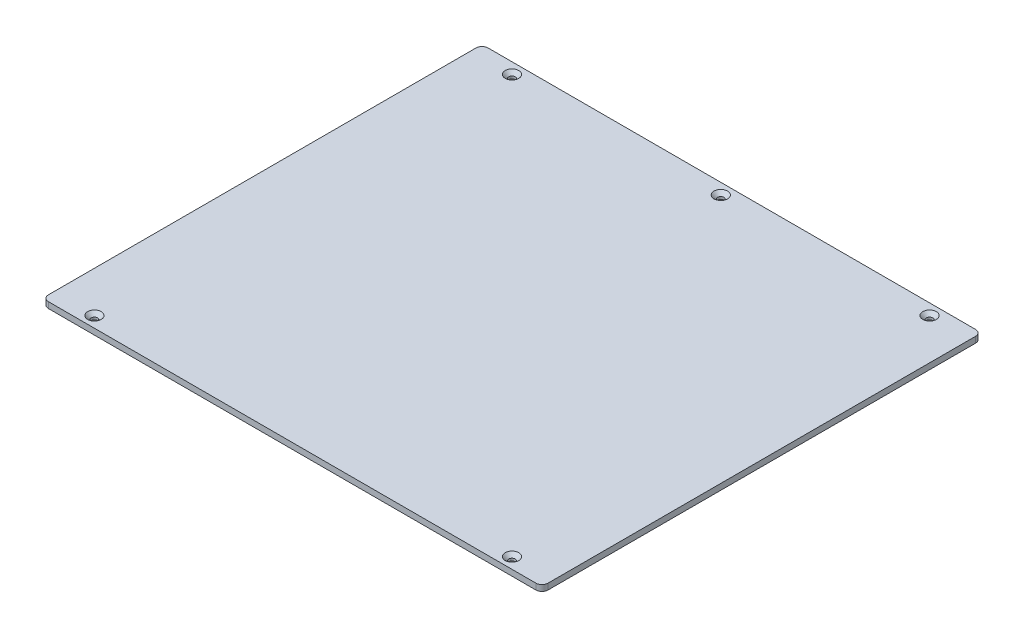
ISO-10303-21;
HEADER;
FILE_DESCRIPTION(('STEP AP214'),'2;1');
FILE_NAME('part.step','',(''),(''),'','','');
FILE_SCHEMA(('AUTOMOTIVE_DESIGN { 1 0 10303 214 1 1 1 1 }'));
ENDSEC;
DATA;
#1=APPLICATION_CONTEXT('core data for automotive mechanical design processes');
#2=APPLICATION_PROTOCOL_DEFINITION('international standard','automotive_design',2000,#1);
#3=PRODUCT_CONTEXT('',#1,'mechanical');
#4=PRODUCT('Part','Part','',(#3));
#5=PRODUCT_RELATED_PRODUCT_CATEGORY('part','',(#4));
#6=PRODUCT_DEFINITION_FORMATION('','',#4);
#7=PRODUCT_DEFINITION_CONTEXT('part definition',#1,'design');
#8=PRODUCT_DEFINITION('design','',#6,#7);
#9=PRODUCT_DEFINITION_SHAPE('','',#8);
#10=(LENGTH_UNIT() NAMED_UNIT(*) SI_UNIT(.MILLI.,.METRE.));
#11=(NAMED_UNIT(*) PLANE_ANGLE_UNIT() SI_UNIT($,.RADIAN.));
#12=(NAMED_UNIT(*) SI_UNIT($,.STERADIAN.) SOLID_ANGLE_UNIT());
#13=UNCERTAINTY_MEASURE_WITH_UNIT(LENGTH_MEASURE(1.E-05),#10,'distance_accuracy_value','');
#14=(GEOMETRIC_REPRESENTATION_CONTEXT(3) GLOBAL_UNCERTAINTY_ASSIGNED_CONTEXT((#13)) GLOBAL_UNIT_ASSIGNED_CONTEXT((#10,
#11,#12)) REPRESENTATION_CONTEXT('',''));
#15=CARTESIAN_POINT('',(0.,0.,0.));
#16=DIRECTION('',(0.,0.,1.));
#17=DIRECTION('',(1.,0.,0.));
#18=AXIS2_PLACEMENT_3D('',#15,#16,#17);
#19=CARTESIAN_POINT('',(0.,3.,0.));
#20=DIRECTION('',(0.,-1.,0.));
#21=DIRECTION('',(0.,0.,-1.));
#22=AXIS2_PLACEMENT_3D('',#19,#20,#21);
#23=PLANE('',#22);
#24=CARTESIAN_POINT('',(-104.5,3.,104.5));
#25=DIRECTION('',(0.,-1.,0.));
#26=DIRECTION('',(0.,0.,-1.));
#27=AXIS2_PLACEMENT_3D('',#24,#25,#26);
#28=CIRCLE('',#27,3.39999999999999);
#29=CARTESIAN_POINT('',(-104.5,3.,101.1));
#30=VERTEX_POINT('',#29);
#31=EDGE_CURVE('E159',#30,#30,#28,.T.);
#32=ORIENTED_EDGE('',*,*,#31,.T.);
#33=EDGE_LOOP('',(#32));
#34=FACE_BOUND('',#33,.T.);
#35=CARTESIAN_POINT('',(104.5,3.,104.5));
#36=DIRECTION('',(0.,-1.,0.));
#37=DIRECTION('',(0.,0.,-1.));
#38=AXIS2_PLACEMENT_3D('',#35,#36,#37);
#39=CIRCLE('',#38,3.39999999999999);
#40=CARTESIAN_POINT('',(104.5,3.,101.1));
#41=VERTEX_POINT('',#40);
#42=EDGE_CURVE('E156',#41,#41,#39,.T.);
#43=ORIENTED_EDGE('',*,*,#42,.T.);
#44=EDGE_LOOP('',(#43));
#45=FACE_BOUND('',#44,.T.);
#46=CARTESIAN_POINT('',(-104.5,3.,-104.5));
#47=DIRECTION('',(0.,-1.,0.));
#48=DIRECTION('',(0.,0.,-1.));
#49=AXIS2_PLACEMENT_3D('',#46,#47,#48);
#50=CIRCLE('',#49,3.39999999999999);
#51=CARTESIAN_POINT('',(-104.5,3.,-107.9));
#52=VERTEX_POINT('',#51);
#53=EDGE_CURVE('E153',#52,#52,#50,.T.);
#54=ORIENTED_EDGE('',*,*,#53,.T.);
#55=EDGE_LOOP('',(#54));
#56=FACE_BOUND('',#55,.T.);
#57=CARTESIAN_POINT('',(104.5,3.,-104.5));
#58=DIRECTION('',(0.,-1.,0.));
#59=DIRECTION('',(0.,0.,-1.));
#60=AXIS2_PLACEMENT_3D('',#57,#58,#59);
#61=CIRCLE('',#60,3.39999999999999);
#62=CARTESIAN_POINT('',(104.5,3.,-107.9));
#63=VERTEX_POINT('',#62);
#64=EDGE_CURVE('E150',#63,#63,#61,.T.);
#65=ORIENTED_EDGE('',*,*,#64,.T.);
#66=EDGE_LOOP('',(#65));
#67=FACE_BOUND('',#66,.T.);
#68=CARTESIAN_POINT('',(0.,3.,-104.5));
#69=DIRECTION('',(0.,-1.,0.));
#70=DIRECTION('',(0.,0.,-1.));
#71=AXIS2_PLACEMENT_3D('',#68,#69,#70);
#72=CIRCLE('',#71,3.39999999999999);
#73=CARTESIAN_POINT('',(0.,3.,-101.1));
#74=VERTEX_POINT('',#73);
#75=EDGE_CURVE('E147',#74,#74,#72,.T.);
#76=ORIENTED_EDGE('',*,*,#75,.T.);
#77=EDGE_LOOP('',(#76));
#78=FACE_BOUND('',#77,.T.);
#79=DIRECTION('',(1.,0.,0.));
#80=VECTOR('',#79,1.);
#81=CARTESIAN_POINT('',(-125.,3.,110.));
#82=LINE('',#81,#80);
#83=CARTESIAN_POINT('',(-122.,3.,110.));
#84=VERTEX_POINT('',#83);
#85=CARTESIAN_POINT('',(122.,3.,110.));
#86=VERTEX_POINT('',#85);
#87=EDGE_CURVE('E138',#84,#86,#82,.T.);
#88=ORIENTED_EDGE('',*,*,#87,.T.);
#89=CARTESIAN_POINT('',(122.,3.,107.));
#90=DIRECTION('',(0.,-1.,0.));
#91=DIRECTION('',(0.,0.,-1.));
#92=AXIS2_PLACEMENT_3D('',#89,#90,#91);
#93=CIRCLE('',#92,3.);
#94=CARTESIAN_POINT('',(125.,3.,107.));
#95=VERTEX_POINT('',#94);
#96=EDGE_CURVE('E187',#86,#95,#93,.F.);
#97=ORIENTED_EDGE('',*,*,#96,.T.);
#98=DIRECTION('',(0.,0.,-1.));
#99=VECTOR('',#98,1.);
#100=CARTESIAN_POINT('',(125.,3.,110.));
#101=LINE('',#100,#99);
#102=CARTESIAN_POINT('',(125.,3.,-107.));
#103=VERTEX_POINT('',#102);
#104=EDGE_CURVE('E121',#95,#103,#101,.T.);
#105=ORIENTED_EDGE('',*,*,#104,.T.);
#106=CARTESIAN_POINT('',(122.,3.,-107.));
#107=DIRECTION('',(0.,-1.,0.));
#108=DIRECTION('',(0.,0.,-1.));
#109=AXIS2_PLACEMENT_3D('',#106,#107,#108);
#110=CIRCLE('',#109,3.);
#111=CARTESIAN_POINT('',(122.,3.,-110.));
#112=VERTEX_POINT('',#111);
#113=EDGE_CURVE('E182',#103,#112,#110,.F.);
#114=ORIENTED_EDGE('',*,*,#113,.T.);
#115=DIRECTION('',(-1.,0.,0.));
#116=VECTOR('',#115,1.);
#117=CARTESIAN_POINT('',(-125.,3.,-110.));
#118=LINE('',#117,#116);
#119=CARTESIAN_POINT('',(-122.,3.,-110.));
#120=VERTEX_POINT('',#119);
#121=EDGE_CURVE('E198',#112,#120,#118,.T.);
#122=ORIENTED_EDGE('',*,*,#121,.T.);
#123=CARTESIAN_POINT('',(-122.,3.,-107.));
#124=DIRECTION('',(0.,-1.,0.));
#125=DIRECTION('',(0.,0.,-1.));
#126=AXIS2_PLACEMENT_3D('',#123,#124,#125);
#127=CIRCLE('',#126,3.);
#128=CARTESIAN_POINT('',(-125.,3.,-107.));
#129=VERTEX_POINT('',#128);
#130=EDGE_CURVE('E57',#120,#129,#127,.F.);
#131=ORIENTED_EDGE('',*,*,#130,.T.);
#132=DIRECTION('',(0.,0.,1.));
#133=VECTOR('',#132,1.);
#134=CARTESIAN_POINT('',(-125.,3.,110.));
#135=LINE('',#134,#133);
#136=CARTESIAN_POINT('',(-125.,3.,107.));
#137=VERTEX_POINT('',#136);
#138=EDGE_CURVE('E206',#129,#137,#135,.T.);
#139=ORIENTED_EDGE('',*,*,#138,.T.);
#140=CARTESIAN_POINT('',(-122.,3.,107.));
#141=DIRECTION('',(0.,-1.,0.));
#142=DIRECTION('',(0.,0.,-1.));
#143=AXIS2_PLACEMENT_3D('',#140,#141,#142);
#144=CIRCLE('',#143,3.);
#145=EDGE_CURVE('E185',#137,#84,#144,.F.);
#146=ORIENTED_EDGE('',*,*,#145,.T.);
#147=EDGE_LOOP('',(#88,#97,#105,#114,#122,#131,#139,#146));
#148=FACE_BOUND('',#147,.T.);
#149=ADVANCED_FACE('F35',(#34,#45,#56,#67,#78,#148),#23,.F.);
#150=CARTESIAN_POINT('',(0.,0.,0.));
#151=DIRECTION('',(0.,-1.,0.));
#152=DIRECTION('',(0.,0.,-1.));
#153=AXIS2_PLACEMENT_3D('',#150,#151,#152);
#154=PLANE('',#153);
#155=CARTESIAN_POINT('',(-104.5,0.,104.5));
#156=DIRECTION('',(0.,1.,0.));
#157=DIRECTION('',(0.,0.,1.));
#158=AXIS2_PLACEMENT_3D('',#155,#156,#157);
#159=CIRCLE('',#158,1.60000000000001);
#160=CARTESIAN_POINT('',(-104.5,0.,106.1));
#161=VERTEX_POINT('',#160);
#162=EDGE_CURVE('E217',#161,#161,#159,.T.);
#163=ORIENTED_EDGE('',*,*,#162,.T.);
#164=EDGE_LOOP('',(#163));
#165=FACE_BOUND('',#164,.T.);
#166=CARTESIAN_POINT('',(-104.5,0.,-104.5));
#167=DIRECTION('',(0.,1.,0.));
#168=DIRECTION('',(0.,0.,-1.));
#169=AXIS2_PLACEMENT_3D('',#166,#167,#168);
#170=CIRCLE('',#169,1.60000000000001);
#171=CARTESIAN_POINT('',(-104.5,0.,-106.1));
#172=VERTEX_POINT('',#171);
#173=EDGE_CURVE('E135',#172,#172,#170,.T.);
#174=ORIENTED_EDGE('',*,*,#173,.T.);
#175=EDGE_LOOP('',(#174));
#176=FACE_BOUND('',#175,.T.);
#177=DIRECTION('',(0.,0.,-1.));
#178=VECTOR('',#177,1.);
#179=CARTESIAN_POINT('',(125.,0.,110.));
#180=LINE('',#179,#178);
#181=CARTESIAN_POINT('',(125.,0.,107.));
#182=VERTEX_POINT('',#181);
#183=CARTESIAN_POINT('',(125.,0.,-107.));
#184=VERTEX_POINT('',#183);
#185=EDGE_CURVE('E118',#182,#184,#180,.T.);
#186=ORIENTED_EDGE('',*,*,#185,.F.);
#187=CARTESIAN_POINT('',(122.,0.,107.));
#188=DIRECTION('',(0.,-1.,0.));
#189=DIRECTION('',(0.,0.,-1.));
#190=AXIS2_PLACEMENT_3D('',#187,#188,#189);
#191=CIRCLE('',#190,3.);
#192=CARTESIAN_POINT('',(122.,0.,110.));
#193=VERTEX_POINT('',#192);
#194=EDGE_CURVE('E101',#182,#193,#191,.T.);
#195=ORIENTED_EDGE('',*,*,#194,.T.);
#196=DIRECTION('',(1.,0.,0.));
#197=VECTOR('',#196,1.);
#198=CARTESIAN_POINT('',(-125.,0.,110.));
#199=LINE('',#198,#197);
#200=CARTESIAN_POINT('',(-122.,0.,110.));
#201=VERTEX_POINT('',#200);
#202=EDGE_CURVE('E142',#201,#193,#199,.T.);
#203=ORIENTED_EDGE('',*,*,#202,.F.);
#204=CARTESIAN_POINT('',(-122.,0.,107.));
#205=DIRECTION('',(0.,-1.,0.));
#206=DIRECTION('',(0.,0.,-1.));
#207=AXIS2_PLACEMENT_3D('',#204,#205,#206);
#208=CIRCLE('',#207,3.);
#209=CARTESIAN_POINT('',(-125.,0.,107.));
#210=VERTEX_POINT('',#209);
#211=EDGE_CURVE('E112',#201,#210,#208,.T.);
#212=ORIENTED_EDGE('',*,*,#211,.T.);
#213=DIRECTION('',(0.,0.,1.));
#214=VECTOR('',#213,1.);
#215=CARTESIAN_POINT('',(-125.,0.,110.));
#216=LINE('',#215,#214);
#217=CARTESIAN_POINT('',(-125.,0.,-107.));
#218=VERTEX_POINT('',#217);
#219=EDGE_CURVE('E132',#218,#210,#216,.T.);
#220=ORIENTED_EDGE('',*,*,#219,.F.);
#221=CARTESIAN_POINT('',(-122.,0.,-107.));
#222=DIRECTION('',(0.,-1.,0.));
#223=DIRECTION('',(0.,0.,-1.));
#224=AXIS2_PLACEMENT_3D('',#221,#222,#223);
#225=CIRCLE('',#224,3.);
#226=CARTESIAN_POINT('',(-122.,0.,-110.));
#227=VERTEX_POINT('',#226);
#228=EDGE_CURVE('E176',#218,#227,#225,.T.);
#229=ORIENTED_EDGE('',*,*,#228,.T.);
#230=DIRECTION('',(-1.,0.,0.));
#231=VECTOR('',#230,1.);
#232=CARTESIAN_POINT('',(-125.,0.,-110.));
#233=LINE('',#232,#231);
#234=CARTESIAN_POINT('',(122.,0.,-110.));
#235=VERTEX_POINT('',#234);
#236=EDGE_CURVE('E128',#235,#227,#233,.T.);
#237=ORIENTED_EDGE('',*,*,#236,.F.);
#238=CARTESIAN_POINT('',(122.,0.,-107.));
#239=DIRECTION('',(0.,-1.,0.));
#240=DIRECTION('',(0.,0.,-1.));
#241=AXIS2_PLACEMENT_3D('',#238,#239,#240);
#242=CIRCLE('',#241,3.);
#243=EDGE_CURVE('E122',#235,#184,#242,.T.);
#244=ORIENTED_EDGE('',*,*,#243,.T.);
#245=EDGE_LOOP('',(#186,#195,#203,#212,#220,#229,#237,#244));
#246=FACE_BOUND('',#245,.T.);
#247=CARTESIAN_POINT('',(104.5,0.,-104.5));
#248=DIRECTION('',(0.,1.,0.));
#249=DIRECTION('',(0.,0.,1.));
#250=AXIS2_PLACEMENT_3D('',#247,#248,#249);
#251=CIRCLE('',#250,1.60000000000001);
#252=CARTESIAN_POINT('',(104.5,0.,-102.9));
#253=VERTEX_POINT('',#252);
#254=EDGE_CURVE('E129',#253,#253,#251,.T.);
#255=ORIENTED_EDGE('',*,*,#254,.T.);
#256=EDGE_LOOP('',(#255));
#257=FACE_BOUND('',#256,.T.);
#258=CARTESIAN_POINT('',(104.5,0.,104.5));
#259=DIRECTION('',(0.,1.,0.));
#260=DIRECTION('',(0.,0.,-1.));
#261=AXIS2_PLACEMENT_3D('',#258,#259,#260);
#262=CIRCLE('',#261,1.60000000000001);
#263=CARTESIAN_POINT('',(104.5,0.,102.9));
#264=VERTEX_POINT('',#263);
#265=EDGE_CURVE('E214',#264,#264,#262,.T.);
#266=ORIENTED_EDGE('',*,*,#265,.T.);
#267=EDGE_LOOP('',(#266));
#268=FACE_BOUND('',#267,.T.);
#269=CARTESIAN_POINT('',(0.,0.,-104.5));
#270=DIRECTION('',(0.,1.,0.));
#271=DIRECTION('',(0.,0.,1.));
#272=AXIS2_PLACEMENT_3D('',#269,#270,#271);
#273=CIRCLE('',#272,1.6);
#274=CARTESIAN_POINT('',(0.,0.,-102.9));
#275=VERTEX_POINT('',#274);
#276=EDGE_CURVE('E220',#275,#275,#273,.T.);
#277=ORIENTED_EDGE('',*,*,#276,.T.);
#278=EDGE_LOOP('',(#277));
#279=FACE_BOUND('',#278,.T.);
#280=ADVANCED_FACE('F125',(#165,#176,#246,#257,#268,#279),#154,.T.);
#281=CARTESIAN_POINT('',(125.,3.,110.));
#282=DIRECTION('',(-1.,0.,0.));
#283=DIRECTION('',(0.,0.,1.));
#284=AXIS2_PLACEMENT_3D('',#281,#282,#283);
#285=PLANE('',#284);
#286=ORIENTED_EDGE('',*,*,#104,.F.);
#287=DIRECTION('',(0.,-1.,0.));
#288=VECTOR('',#287,1.);
#289=CARTESIAN_POINT('',(125.,3.,107.));
#290=LINE('',#289,#288);
#291=EDGE_CURVE('E105',#95,#182,#290,.T.);
#292=ORIENTED_EDGE('',*,*,#291,.T.);
#293=ORIENTED_EDGE('',*,*,#185,.T.);
#294=DIRECTION('',(0.,-1.,0.));
#295=VECTOR('',#294,1.);
#296=CARTESIAN_POINT('',(125.,3.,-107.));
#297=LINE('',#296,#295);
#298=EDGE_CURVE('E123',#184,#103,#297,.F.);
#299=ORIENTED_EDGE('',*,*,#298,.T.);
#300=EDGE_LOOP('',(#286,#292,#293,#299));
#301=FACE_BOUND('',#300,.T.);
#302=ADVANCED_FACE('F117',(#301),#285,.F.);
#303=CARTESIAN_POINT('',(-125.,3.,-110.));
#304=DIRECTION('',(0.,0.,1.));
#305=DIRECTION('',(1.,0.,0.));
#306=AXIS2_PLACEMENT_3D('',#303,#304,#305);
#307=PLANE('',#306);
#308=ORIENTED_EDGE('',*,*,#236,.T.);
#309=DIRECTION('',(0.,-1.,0.));
#310=VECTOR('',#309,1.);
#311=CARTESIAN_POINT('',(-122.,3.,-110.));
#312=LINE('',#311,#310);
#313=EDGE_CURVE('E11',#227,#120,#312,.F.);
#314=ORIENTED_EDGE('',*,*,#313,.T.);
#315=ORIENTED_EDGE('',*,*,#121,.F.);
#316=DIRECTION('',(0.,-1.,0.));
#317=VECTOR('',#316,1.);
#318=CARTESIAN_POINT('',(122.,3.,-110.));
#319=LINE('',#318,#317);
#320=EDGE_CURVE('E43',#112,#235,#319,.T.);
#321=ORIENTED_EDGE('',*,*,#320,.T.);
#322=EDGE_LOOP('',(#308,#314,#315,#321));
#323=FACE_BOUND('',#322,.T.);
#324=ADVANCED_FACE('F196',(#323),#307,.F.);
#325=CARTESIAN_POINT('',(-125.,3.,110.));
#326=DIRECTION('',(1.,0.,0.));
#327=DIRECTION('',(0.,0.,-1.));
#328=AXIS2_PLACEMENT_3D('',#325,#326,#327);
#329=PLANE('',#328);
#330=ORIENTED_EDGE('',*,*,#219,.T.);
#331=DIRECTION('',(0.,-1.,0.));
#332=VECTOR('',#331,1.);
#333=CARTESIAN_POINT('',(-125.,3.,107.));
#334=LINE('',#333,#332);
#335=EDGE_CURVE('E50',#210,#137,#334,.F.);
#336=ORIENTED_EDGE('',*,*,#335,.T.);
#337=ORIENTED_EDGE('',*,*,#138,.F.);
#338=DIRECTION('',(0.,-1.,0.));
#339=VECTOR('',#338,1.);
#340=CARTESIAN_POINT('',(-125.,3.,-107.));
#341=LINE('',#340,#339);
#342=EDGE_CURVE('E189',#129,#218,#341,.T.);
#343=ORIENTED_EDGE('',*,*,#342,.T.);
#344=EDGE_LOOP('',(#330,#336,#337,#343));
#345=FACE_BOUND('',#344,.T.);
#346=ADVANCED_FACE('F205',(#345),#329,.F.);
#347=CARTESIAN_POINT('',(-125.,3.,110.));
#348=DIRECTION('',(0.,0.,-1.));
#349=DIRECTION('',(-1.,0.,0.));
#350=AXIS2_PLACEMENT_3D('',#347,#348,#349);
#351=PLANE('',#350);
#352=ORIENTED_EDGE('',*,*,#202,.T.);
#353=DIRECTION('',(0.,-1.,0.));
#354=VECTOR('',#353,1.);
#355=CARTESIAN_POINT('',(122.,3.,110.));
#356=LINE('',#355,#354);
#357=EDGE_CURVE('E106',#193,#86,#356,.F.);
#358=ORIENTED_EDGE('',*,*,#357,.T.);
#359=ORIENTED_EDGE('',*,*,#87,.F.);
#360=DIRECTION('',(0.,-1.,0.));
#361=VECTOR('',#360,1.);
#362=CARTESIAN_POINT('',(-122.,3.,110.));
#363=LINE('',#362,#361);
#364=EDGE_CURVE('E111',#84,#201,#363,.T.);
#365=ORIENTED_EDGE('',*,*,#364,.T.);
#366=EDGE_LOOP('',(#352,#358,#359,#365));
#367=FACE_BOUND('',#366,.T.);
#368=ADVANCED_FACE('F254',(#367),#351,.F.);
#369=CARTESIAN_POINT('',(104.5,3.,-104.5));
#370=DIRECTION('',(0.,-1.,0.));
#371=DIRECTION('',(0.,0.,-1.));
#372=AXIS2_PLACEMENT_3D('',#369,#370,#371);
#373=CYLINDRICAL_SURFACE('',#372,1.60000000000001);
#374=CARTESIAN_POINT('',(104.5,1.20000000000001,-104.5));
#375=DIRECTION('',(0.,-1.,0.));
#376=DIRECTION('',(0.,0.,-1.));
#377=AXIS2_PLACEMENT_3D('',#374,#375,#376);
#378=CIRCLE('',#377,1.60000000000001);
#379=CARTESIAN_POINT('',(104.5,1.20000000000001,-106.1));
#380=VERTEX_POINT('',#379);
#381=EDGE_CURVE('E168',#380,#380,#378,.F.);
#382=ORIENTED_EDGE('',*,*,#381,.T.);
#383=EDGE_LOOP('',(#382));
#384=FACE_BOUND('',#383,.T.);
#385=ORIENTED_EDGE('',*,*,#254,.F.);
#386=EDGE_LOOP('',(#385));
#387=FACE_BOUND('',#386,.T.);
#388=ADVANCED_FACE('F251',(#384,#387),#373,.F.);
#389=CARTESIAN_POINT('',(-104.5,3.,-104.5));
#390=DIRECTION('',(0.,-1.,0.));
#391=DIRECTION('',(0.,0.,-1.));
#392=AXIS2_PLACEMENT_3D('',#389,#390,#391);
#393=CYLINDRICAL_SURFACE('',#392,1.60000000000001);
#394=CARTESIAN_POINT('',(-104.5,1.20000000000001,-104.5));
#395=DIRECTION('',(0.,-1.,0.));
#396=DIRECTION('',(0.,0.,-1.));
#397=AXIS2_PLACEMENT_3D('',#394,#395,#396);
#398=CIRCLE('',#397,1.60000000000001);
#399=CARTESIAN_POINT('',(-104.5,1.20000000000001,-106.1));
#400=VERTEX_POINT('',#399);
#401=EDGE_CURVE('E165',#400,#400,#398,.F.);
#402=ORIENTED_EDGE('',*,*,#401,.T.);
#403=EDGE_LOOP('',(#402));
#404=FACE_BOUND('',#403,.T.);
#405=ORIENTED_EDGE('',*,*,#173,.F.);
#406=EDGE_LOOP('',(#405));
#407=FACE_BOUND('',#406,.T.);
#408=ADVANCED_FACE('F393',(#404,#407),#393,.F.);
#409=CARTESIAN_POINT('',(104.5,3.,104.5));
#410=DIRECTION('',(0.,-1.,0.));
#411=DIRECTION('',(0.,0.,-1.));
#412=AXIS2_PLACEMENT_3D('',#409,#410,#411);
#413=CYLINDRICAL_SURFACE('',#412,1.60000000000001);
#414=CARTESIAN_POINT('',(104.5,1.20000000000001,104.5));
#415=DIRECTION('',(0.,-1.,0.));
#416=DIRECTION('',(0.,0.,-1.));
#417=AXIS2_PLACEMENT_3D('',#414,#415,#416);
#418=CIRCLE('',#417,1.60000000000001);
#419=CARTESIAN_POINT('',(104.5,1.20000000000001,102.9));
#420=VERTEX_POINT('',#419);
#421=EDGE_CURVE('E162',#420,#420,#418,.F.);
#422=ORIENTED_EDGE('',*,*,#421,.T.);
#423=EDGE_LOOP('',(#422));
#424=FACE_BOUND('',#423,.T.);
#425=ORIENTED_EDGE('',*,*,#265,.F.);
#426=EDGE_LOOP('',(#425));
#427=FACE_BOUND('',#426,.T.);
#428=ADVANCED_FACE('F238',(#424,#427),#413,.F.);
#429=CARTESIAN_POINT('',(-104.5,3.,104.5));
#430=DIRECTION('',(0.,-1.,0.));
#431=DIRECTION('',(0.,0.,-1.));
#432=AXIS2_PLACEMENT_3D('',#429,#430,#431);
#433=CYLINDRICAL_SURFACE('',#432,1.60000000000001);
#434=CARTESIAN_POINT('',(-104.5,1.20000000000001,104.5));
#435=DIRECTION('',(0.,-1.,0.));
#436=DIRECTION('',(0.,0.,-1.));
#437=AXIS2_PLACEMENT_3D('',#434,#435,#436);
#438=CIRCLE('',#437,1.60000000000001);
#439=CARTESIAN_POINT('',(-104.5,1.20000000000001,102.9));
#440=VERTEX_POINT('',#439);
#441=EDGE_CURVE('E144',#440,#440,#438,.F.);
#442=ORIENTED_EDGE('',*,*,#441,.T.);
#443=EDGE_LOOP('',(#442));
#444=FACE_BOUND('',#443,.T.);
#445=ORIENTED_EDGE('',*,*,#162,.F.);
#446=EDGE_LOOP('',(#445));
#447=FACE_BOUND('',#446,.T.);
#448=ADVANCED_FACE('F228',(#444,#447),#433,.F.);
#449=CARTESIAN_POINT('',(0.,3.,-104.5));
#450=DIRECTION('',(0.,-1.,0.));
#451=DIRECTION('',(0.,0.,-1.));
#452=AXIS2_PLACEMENT_3D('',#449,#450,#451);
#453=CYLINDRICAL_SURFACE('',#452,1.6);
#454=CARTESIAN_POINT('',(0.,1.20000000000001,-104.5));
#455=DIRECTION('',(0.,-1.,0.));
#456=DIRECTION('',(0.,0.,-1.));
#457=AXIS2_PLACEMENT_3D('',#454,#455,#456);
#458=CIRCLE('',#457,1.6);
#459=CARTESIAN_POINT('',(0.,1.20000000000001,-102.9));
#460=VERTEX_POINT('',#459);
#461=EDGE_CURVE('E171',#460,#460,#458,.F.);
#462=ORIENTED_EDGE('',*,*,#461,.T.);
#463=EDGE_LOOP('',(#462));
#464=FACE_BOUND('',#463,.T.);
#465=ORIENTED_EDGE('',*,*,#276,.F.);
#466=EDGE_LOOP('',(#465));
#467=FACE_BOUND('',#466,.T.);
#468=ADVANCED_FACE('F225',(#464,#467),#453,.F.);
#469=CARTESIAN_POINT('',(-104.5,1.20000000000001,104.5));
#470=DIRECTION('',(0.,1.,0.));
#471=DIRECTION('',(0.,0.,1.));
#472=AXIS2_PLACEMENT_3D('',#469,#470,#471);
#473=CONICAL_SURFACE('',#472,1.60000000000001,0.785398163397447);
#474=ORIENTED_EDGE('',*,*,#31,.F.);
#475=EDGE_LOOP('',(#474));
#476=FACE_BOUND('',#475,.T.);
#477=ORIENTED_EDGE('',*,*,#441,.F.);
#478=EDGE_LOOP('',(#477));
#479=FACE_BOUND('',#478,.T.);
#480=ADVANCED_FACE('F227',(#476,#479),#473,.F.);
#481=CARTESIAN_POINT('',(104.5,1.20000000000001,104.5));
#482=DIRECTION('',(0.,1.,0.));
#483=DIRECTION('',(0.,0.,1.));
#484=AXIS2_PLACEMENT_3D('',#481,#482,#483);
#485=CONICAL_SURFACE('',#484,1.60000000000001,0.785398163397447);
#486=ORIENTED_EDGE('',*,*,#42,.F.);
#487=EDGE_LOOP('',(#486));
#488=FACE_BOUND('',#487,.T.);
#489=ORIENTED_EDGE('',*,*,#421,.F.);
#490=EDGE_LOOP('',(#489));
#491=FACE_BOUND('',#490,.T.);
#492=ADVANCED_FACE('F235',(#488,#491),#485,.F.);
#493=CARTESIAN_POINT('',(-104.5,1.20000000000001,-104.5));
#494=DIRECTION('',(0.,1.,0.));
#495=DIRECTION('',(0.,0.,1.));
#496=AXIS2_PLACEMENT_3D('',#493,#494,#495);
#497=CONICAL_SURFACE('',#496,1.60000000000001,0.785398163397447);
#498=ORIENTED_EDGE('',*,*,#53,.F.);
#499=EDGE_LOOP('',(#498));
#500=FACE_BOUND('',#499,.T.);
#501=ORIENTED_EDGE('',*,*,#401,.F.);
#502=EDGE_LOOP('',(#501));
#503=FACE_BOUND('',#502,.T.);
#504=ADVANCED_FACE('F266',(#500,#503),#497,.F.);
#505=CARTESIAN_POINT('',(104.5,1.20000000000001,-104.5));
#506=DIRECTION('',(0.,1.,0.));
#507=DIRECTION('',(0.,0.,1.));
#508=AXIS2_PLACEMENT_3D('',#505,#506,#507);
#509=CONICAL_SURFACE('',#508,1.60000000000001,0.785398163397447);
#510=ORIENTED_EDGE('',*,*,#64,.F.);
#511=EDGE_LOOP('',(#510));
#512=FACE_BOUND('',#511,.T.);
#513=ORIENTED_EDGE('',*,*,#381,.F.);
#514=EDGE_LOOP('',(#513));
#515=FACE_BOUND('',#514,.T.);
#516=ADVANCED_FACE('F270',(#512,#515),#509,.F.);
#517=CARTESIAN_POINT('',(0.,1.20000000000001,-104.5));
#518=DIRECTION('',(0.,1.,0.));
#519=DIRECTION('',(0.,0.,1.));
#520=AXIS2_PLACEMENT_3D('',#517,#518,#519);
#521=CONICAL_SURFACE('',#520,1.6,0.785398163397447);
#522=CARTESIAN_POINT('',(0.,3.,-101.1));
#523=CARTESIAN_POINT('',(0.,2.98125,-101.11875));
#524=CARTESIAN_POINT('',(0.,2.9625,-101.1375));
#525=CARTESIAN_POINT('',(0.,2.925,-101.175));
#526=CARTESIAN_POINT('',(0.,2.90625,-101.19375));
#527=CARTESIAN_POINT('',(0.,2.86875,-101.23125));
#528=CARTESIAN_POINT('',(0.,2.85,-101.25));
#529=CARTESIAN_POINT('',(0.,2.8125,-101.2875));
#530=CARTESIAN_POINT('',(0.,2.79375,-101.30625));
#531=CARTESIAN_POINT('',(0.,2.75625,-101.34375));
#532=CARTESIAN_POINT('',(0.,2.7375,-101.3625));
#533=CARTESIAN_POINT('',(0.,2.7,-101.4));
#534=CARTESIAN_POINT('',(0.,2.68125,-101.41875));
#535=CARTESIAN_POINT('',(0.,2.64375,-101.45625));
#536=CARTESIAN_POINT('',(0.,2.625,-101.475));
#537=CARTESIAN_POINT('',(0.,2.5875,-101.5125));
#538=CARTESIAN_POINT('',(0.,2.56875,-101.53125));
#539=CARTESIAN_POINT('',(0.,2.53125,-101.56875));
#540=CARTESIAN_POINT('',(0.,2.5125,-101.5875));
#541=CARTESIAN_POINT('',(0.,2.475,-101.625));
#542=CARTESIAN_POINT('',(0.,2.45625,-101.64375));
#543=CARTESIAN_POINT('',(0.,2.41875,-101.68125));
#544=CARTESIAN_POINT('',(0.,2.4,-101.7));
#545=CARTESIAN_POINT('',(0.,2.3625,-101.7375));
#546=CARTESIAN_POINT('',(0.,2.34375000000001,-101.75625));
#547=CARTESIAN_POINT('',(0.,2.30625000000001,-101.79375));
#548=CARTESIAN_POINT('',(0.,2.2875,-101.8125));
#549=CARTESIAN_POINT('',(0.,2.25,-101.85));
#550=CARTESIAN_POINT('',(0.,2.23125000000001,-101.86875));
#551=CARTESIAN_POINT('',(0.,2.19375000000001,-101.90625));
#552=CARTESIAN_POINT('',(0.,2.175,-101.925));
#553=CARTESIAN_POINT('',(0.,2.1375,-101.9625));
#554=CARTESIAN_POINT('',(0.,2.11875000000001,-101.98125));
#555=CARTESIAN_POINT('',(0.,2.08125000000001,-102.01875));
#556=CARTESIAN_POINT('',(0.,2.06250000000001,-102.0375));
#557=CARTESIAN_POINT('',(0.,2.025,-102.075));
#558=CARTESIAN_POINT('',(0.,2.00625,-102.09375));
#559=CARTESIAN_POINT('',(0.,1.96875000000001,-102.13125));
#560=CARTESIAN_POINT('',(0.,1.95000000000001,-102.15));
#561=CARTESIAN_POINT('',(0.,1.91250000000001,-102.1875));
#562=CARTESIAN_POINT('',(0.,1.89375000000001,-102.20625));
#563=CARTESIAN_POINT('',(0.,1.85625000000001,-102.24375));
#564=CARTESIAN_POINT('',(0.,1.83750000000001,-102.2625));
#565=CARTESIAN_POINT('',(0.,1.80000000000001,-102.3));
#566=CARTESIAN_POINT('',(0.,1.78125000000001,-102.31875));
#567=CARTESIAN_POINT('',(0.,1.74375000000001,-102.35625));
#568=CARTESIAN_POINT('',(0.,1.72500000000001,-102.375));
#569=CARTESIAN_POINT('',(0.,1.68750000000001,-102.4125));
#570=CARTESIAN_POINT('',(0.,1.66875000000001,-102.43125));
#571=CARTESIAN_POINT('',(0.,1.63125000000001,-102.46875));
#572=CARTESIAN_POINT('',(0.,1.61250000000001,-102.4875));
#573=CARTESIAN_POINT('',(0.,1.57500000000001,-102.525));
#574=CARTESIAN_POINT('',(0.,1.55625000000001,-102.54375));
#575=CARTESIAN_POINT('',(0.,1.51875000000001,-102.58125));
#576=CARTESIAN_POINT('',(0.,1.50000000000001,-102.6));
#577=CARTESIAN_POINT('',(0.,1.46250000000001,-102.6375));
#578=CARTESIAN_POINT('',(0.,1.44375000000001,-102.65625));
#579=CARTESIAN_POINT('',(0.,1.40625000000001,-102.69375));
#580=CARTESIAN_POINT('',(0.,1.38750000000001,-102.7125));
#581=CARTESIAN_POINT('',(0.,1.35000000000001,-102.75));
#582=CARTESIAN_POINT('',(0.,1.33125000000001,-102.76875));
#583=CARTESIAN_POINT('',(0.,1.29375000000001,-102.80625));
#584=CARTESIAN_POINT('',(0.,1.27500000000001,-102.825));
#585=CARTESIAN_POINT('',(0.,1.23750000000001,-102.8625));
#586=CARTESIAN_POINT('',(0.,1.21875000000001,-102.88125));
#587=CARTESIAN_POINT('',(0.,1.20000000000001,-102.9));
#588=B_SPLINE_CURVE_WITH_KNOTS('',3,(#522,#523,#524,#525,#526,#527,#528,#529,#530,#531,#532,
#533,#534,#535,#536,#537,#538,#539,#540,#541,#542,#543,#544,#545,#546,#547,#548,#549,#550,#551,
#552,#553,#554,#555,#556,#557,#558,#559,#560,#561,#562,#563,#564,#565,#566,#567,#568,#569,#570,
#571,#572,#573,#574,#575,#576,#577,#578,#579,#580,#581,#582,#583,#584,#585,#586,#587),
.UNSPECIFIED.,.F.,.F.,(4,2,2,2,2,2,2,2,2,2,2,2,2,2,2,2,2,2,2,2,2,2,2,2,2,2,2,2,2,2,2,2,4),(0.,
0.0795495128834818,0.159099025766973,0.238648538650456,0.318198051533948,0.39774756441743,
0.477297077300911,0.556846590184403,0.636396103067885,0.715945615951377,0.795495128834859,
0.875044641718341,0.954594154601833,1.03414366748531,1.11369318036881,1.19324269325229,
1.27279220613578,1.35234171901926,1.43189123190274,1.51144074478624,1.59099025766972,
1.67053977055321,1.75008928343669,1.82963879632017,1.90918830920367,1.98873782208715,
2.06828733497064,2.14783684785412,2.22738636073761,2.3069358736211,2.38648538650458,
2.46603489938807,2.54558441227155),.UNSPECIFIED.);
#589=EDGE_CURVE('BSEAM274',#74,#460,#588,.T.);
#590=ORIENTED_EDGE('',*,*,#75,.F.);
#591=ORIENTED_EDGE('',*,*,#461,.F.);
#592=ORIENTED_EDGE('',*,*,#589,.T.);
#593=ORIENTED_EDGE('',*,*,#589,.F.);
#594=EDGE_LOOP('',(#590,#592,#591,#593));
#595=FACE_BOUND('',#594,.T.);
#596=ADVANCED_FACE('F274',(#595),#521,.F.);
#597=CARTESIAN_POINT('',(122.,3.,107.));
#598=DIRECTION('',(0.,-1.,0.));
#599=DIRECTION('',(0.,0.,-1.));
#600=AXIS2_PLACEMENT_3D('',#597,#598,#599);
#601=CYLINDRICAL_SURFACE('',#600,3.);
#602=ORIENTED_EDGE('',*,*,#96,.F.);
#603=ORIENTED_EDGE('',*,*,#357,.F.);
#604=ORIENTED_EDGE('',*,*,#194,.F.);
#605=ORIENTED_EDGE('',*,*,#291,.F.);
#606=EDGE_LOOP('',(#602,#603,#604,#605));
#607=FACE_BOUND('',#606,.T.);
#608=ADVANCED_FACE('F104',(#607),#601,.T.);
#609=CARTESIAN_POINT('',(-122.,3.,107.));
#610=DIRECTION('',(0.,-1.,0.));
#611=DIRECTION('',(0.,0.,-1.));
#612=AXIS2_PLACEMENT_3D('',#609,#610,#611);
#613=CYLINDRICAL_SURFACE('',#612,3.);
#614=ORIENTED_EDGE('',*,*,#145,.F.);
#615=ORIENTED_EDGE('',*,*,#335,.F.);
#616=ORIENTED_EDGE('',*,*,#211,.F.);
#617=ORIENTED_EDGE('',*,*,#364,.F.);
#618=EDGE_LOOP('',(#614,#615,#616,#617));
#619=FACE_BOUND('',#618,.T.);
#620=ADVANCED_FACE('F281',(#619),#613,.T.);
#621=CARTESIAN_POINT('',(-122.,3.,-107.));
#622=DIRECTION('',(0.,-1.,0.));
#623=DIRECTION('',(0.,0.,-1.));
#624=AXIS2_PLACEMENT_3D('',#621,#622,#623);
#625=CYLINDRICAL_SURFACE('',#624,3.);
#626=ORIENTED_EDGE('',*,*,#130,.F.);
#627=ORIENTED_EDGE('',*,*,#313,.F.);
#628=ORIENTED_EDGE('',*,*,#228,.F.);
#629=ORIENTED_EDGE('',*,*,#342,.F.);
#630=EDGE_LOOP('',(#626,#627,#628,#629));
#631=FACE_BOUND('',#630,.T.);
#632=ADVANCED_FACE('F204',(#631),#625,.T.);
#633=CARTESIAN_POINT('',(122.,3.,-107.));
#634=DIRECTION('',(0.,-1.,0.));
#635=DIRECTION('',(0.,0.,-1.));
#636=AXIS2_PLACEMENT_3D('',#633,#634,#635);
#637=CYLINDRICAL_SURFACE('',#636,3.);
#638=ORIENTED_EDGE('',*,*,#113,.F.);
#639=ORIENTED_EDGE('',*,*,#298,.F.);
#640=ORIENTED_EDGE('',*,*,#243,.F.);
#641=ORIENTED_EDGE('',*,*,#320,.F.);
#642=EDGE_LOOP('',(#638,#639,#640,#641));
#643=FACE_BOUND('',#642,.T.);
#644=ADVANCED_FACE('F37',(#643),#637,.T.);
#645=CLOSED_SHELL('',(#149,#280,#302,#324,#346,#368,#388,#408,#428,#448,#468,#480,#492,#504,
#516,#596,#608,#620,#632,#644));
#646=MANIFOLD_SOLID_BREP('B2',#645);
#647=ADVANCED_BREP_SHAPE_REPRESENTATION('',(#18,#646),#14);
#648=SHAPE_DEFINITION_REPRESENTATION(#9,#647);
ENDSEC;
END-ISO-10303-21;
